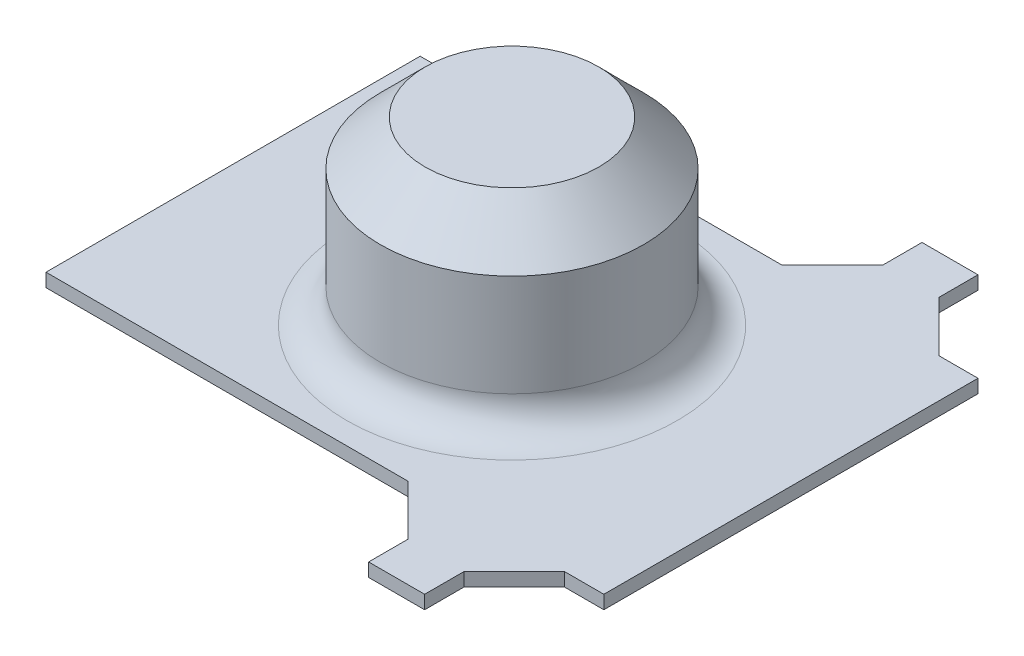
ISO-10303-21;
HEADER;
FILE_DESCRIPTION(('STEP AP214'),'2;1');
FILE_NAME('part.step','',(''),(''),'','','');
FILE_SCHEMA(('AUTOMOTIVE_DESIGN { 1 0 10303 214 1 1 1 1 }'));
ENDSEC;
DATA;
#1=APPLICATION_CONTEXT('core data for automotive mechanical design processes');
#2=APPLICATION_PROTOCOL_DEFINITION('international standard','automotive_design',2000,#1);
#3=PRODUCT_CONTEXT('',#1,'mechanical');
#4=PRODUCT('Part','Part','',(#3));
#5=PRODUCT_RELATED_PRODUCT_CATEGORY('part','',(#4));
#6=PRODUCT_DEFINITION_FORMATION('','',#4);
#7=PRODUCT_DEFINITION_CONTEXT('part definition',#1,'design');
#8=PRODUCT_DEFINITION('design','',#6,#7);
#9=PRODUCT_DEFINITION_SHAPE('','',#8);
#10=(LENGTH_UNIT() NAMED_UNIT(*) SI_UNIT(.MILLI.,.METRE.));
#11=(NAMED_UNIT(*) PLANE_ANGLE_UNIT() SI_UNIT($,.RADIAN.));
#12=(NAMED_UNIT(*) SI_UNIT($,.STERADIAN.) SOLID_ANGLE_UNIT());
#13=UNCERTAINTY_MEASURE_WITH_UNIT(LENGTH_MEASURE(1.E-05),#10,'distance_accuracy_value','');
#14=(GEOMETRIC_REPRESENTATION_CONTEXT(3) GLOBAL_UNCERTAINTY_ASSIGNED_CONTEXT((#13)) GLOBAL_UNIT_ASSIGNED_CONTEXT((#10,
#11,#12)) REPRESENTATION_CONTEXT('',''));
#15=CARTESIAN_POINT('',(0.,0.,0.));
#16=DIRECTION('',(0.,0.,1.));
#17=DIRECTION('',(1.,0.,0.));
#18=AXIS2_PLACEMENT_3D('',#15,#16,#17);
#19=CARTESIAN_POINT('',(11.9,1.2,0.));
#20=DIRECTION('',(1.,0.,0.));
#21=DIRECTION('',(0.,0.,-1.));
#22=AXIS2_PLACEMENT_3D('',#19,#20,#21);
#23=PLANE('',#22);
#24=DIRECTION('',(0.,0.,1.));
#25=VECTOR('',#24,1.);
#26=CARTESIAN_POINT('',(11.9,0.,0.));
#27=LINE('',#26,#25);
#28=CARTESIAN_POINT('',(11.9,0.,-24.7));
#29=VERTEX_POINT('',#28);
#30=CARTESIAN_POINT('',(11.9,0.,-21.1971991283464));
#31=VERTEX_POINT('',#30);
#32=EDGE_CURVE('E193',#29,#31,#27,.T.);
#33=ORIENTED_EDGE('',*,*,#32,.T.);
#34=DIRECTION('',(0.,-1.,0.));
#35=VECTOR('',#34,1.);
#36=CARTESIAN_POINT('',(11.9,1.2,-21.1971991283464));
#37=LINE('',#36,#35);
#38=CARTESIAN_POINT('',(11.9,1.2,-21.1971991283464));
#39=VERTEX_POINT('',#38);
#40=EDGE_CURVE('E286',#39,#31,#37,.T.);
#41=ORIENTED_EDGE('',*,*,#40,.F.);
#42=DIRECTION('',(0.,0.,1.));
#43=VECTOR('',#42,1.);
#44=CARTESIAN_POINT('',(11.9,1.2,0.));
#45=LINE('',#44,#43);
#46=CARTESIAN_POINT('',(11.9,1.2,-24.7));
#47=VERTEX_POINT('',#46);
#48=EDGE_CURVE('E245',#47,#39,#45,.T.);
#49=ORIENTED_EDGE('',*,*,#48,.F.);
#50=DIRECTION('',(0.,-1.,0.));
#51=VECTOR('',#50,1.);
#52=CARTESIAN_POINT('',(11.9,1.2,-24.7));
#53=LINE('',#52,#51);
#54=EDGE_CURVE('E189',#47,#29,#53,.T.);
#55=ORIENTED_EDGE('',*,*,#54,.T.);
#56=EDGE_LOOP('',(#33,#41,#49,#55));
#57=FACE_BOUND('',#56,.T.);
#58=ADVANCED_FACE('F43',(#57),#23,.F.);
#59=CARTESIAN_POINT('',(-4.64859956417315,1.2,-4.6485995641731));
#60=DIRECTION('',(0.707106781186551,0.,0.707106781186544));
#61=DIRECTION('',(0.707106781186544,0.,-0.707106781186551));
#62=AXIS2_PLACEMENT_3D('',#59,#60,#61);
#63=PLANE('',#62);
#64=DIRECTION('',(-0.707106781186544,0.,0.707106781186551));
#65=VECTOR('',#64,1.);
#66=CARTESIAN_POINT('',(-4.64859956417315,0.,-4.6485995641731));
#67=LINE('',#66,#65);
#68=CARTESIAN_POINT('',(7.40280087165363,0.,-16.7));
#69=VERTEX_POINT('',#68);
#70=EDGE_CURVE('E197',#31,#69,#67,.T.);
#71=ORIENTED_EDGE('',*,*,#70,.T.);
#72=DIRECTION('',(0.,-1.,0.));
#73=VECTOR('',#72,1.);
#74=CARTESIAN_POINT('',(7.40280087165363,1.2,-16.7));
#75=LINE('',#74,#73);
#76=CARTESIAN_POINT('',(7.40280087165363,1.2,-16.7));
#77=VERTEX_POINT('',#76);
#78=EDGE_CURVE('E283',#77,#69,#75,.T.);
#79=ORIENTED_EDGE('',*,*,#78,.F.);
#80=DIRECTION('',(-0.707106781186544,0.,0.707106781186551));
#81=VECTOR('',#80,1.);
#82=CARTESIAN_POINT('',(-4.64859956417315,1.2,-4.6485995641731));
#83=LINE('',#82,#81);
#84=EDGE_CURVE('E129',#39,#77,#83,.T.);
#85=ORIENTED_EDGE('',*,*,#84,.F.);
#86=ORIENTED_EDGE('',*,*,#40,.T.);
#87=EDGE_LOOP('',(#71,#79,#85,#86));
#88=FACE_BOUND('',#87,.T.);
#89=ADVANCED_FACE('F313',(#88),#63,.F.);
#90=CARTESIAN_POINT('',(0.,1.2,-16.7));
#91=DIRECTION('',(0.,0.,-1.));
#92=DIRECTION('',(-1.,0.,0.));
#93=AXIS2_PLACEMENT_3D('',#90,#91,#92);
#94=PLANE('',#93);
#95=DIRECTION('',(1.,0.,0.));
#96=VECTOR('',#95,1.);
#97=CARTESIAN_POINT('',(0.,0.,-16.7));
#98=LINE('',#97,#96);
#99=CARTESIAN_POINT('',(-24.9,0.,-16.7));
#100=VERTEX_POINT('',#99);
#101=EDGE_CURVE('E201',#100,#69,#98,.T.);
#102=ORIENTED_EDGE('',*,*,#101,.F.);
#103=DIRECTION('',(0.,-1.,0.));
#104=VECTOR('',#103,1.);
#105=CARTESIAN_POINT('',(-24.9,1.2,-16.7));
#106=LINE('',#105,#104);
#107=CARTESIAN_POINT('',(-24.9,1.2,-16.7));
#108=VERTEX_POINT('',#107);
#109=EDGE_CURVE('E280',#108,#100,#106,.T.);
#110=ORIENTED_EDGE('',*,*,#109,.F.);
#111=DIRECTION('',(1.,0.,0.));
#112=VECTOR('',#111,1.);
#113=CARTESIAN_POINT('',(0.,1.2,-16.7));
#114=LINE('',#113,#112);
#115=EDGE_CURVE('E533',#108,#77,#114,.T.);
#116=ORIENTED_EDGE('',*,*,#115,.T.);
#117=ORIENTED_EDGE('',*,*,#78,.T.);
#118=EDGE_LOOP('',(#102,#110,#116,#117));
#119=FACE_BOUND('',#118,.T.);
#120=ADVANCED_FACE('F319',(#119),#94,.T.);
#121=CARTESIAN_POINT('',(-24.9,1.2,0.));
#122=DIRECTION('',(-1.,0.,0.));
#123=DIRECTION('',(0.,0.,1.));
#124=AXIS2_PLACEMENT_3D('',#121,#122,#123);
#125=PLANE('',#124);
#126=DIRECTION('',(0.,0.,-1.));
#127=VECTOR('',#126,1.);
#128=CARTESIAN_POINT('',(-24.9,0.,0.));
#129=LINE('',#128,#127);
#130=CARTESIAN_POINT('',(-24.9,0.,16.7));
#131=VERTEX_POINT('',#130);
#132=EDGE_CURVE('E205',#131,#100,#129,.T.);
#133=ORIENTED_EDGE('',*,*,#132,.F.);
#134=DIRECTION('',(0.,-1.,0.));
#135=VECTOR('',#134,1.);
#136=CARTESIAN_POINT('',(-24.9,1.2,16.7));
#137=LINE('',#136,#135);
#138=CARTESIAN_POINT('',(-24.9,1.2,16.7));
#139=VERTEX_POINT('',#138);
#140=EDGE_CURVE('E277',#139,#131,#137,.T.);
#141=ORIENTED_EDGE('',*,*,#140,.F.);
#142=DIRECTION('',(0.,0.,-1.));
#143=VECTOR('',#142,1.);
#144=CARTESIAN_POINT('',(-24.9,1.2,0.));
#145=LINE('',#144,#143);
#146=EDGE_CURVE('E530',#139,#108,#145,.T.);
#147=ORIENTED_EDGE('',*,*,#146,.T.);
#148=ORIENTED_EDGE('',*,*,#109,.T.);
#149=EDGE_LOOP('',(#133,#141,#147,#148));
#150=FACE_BOUND('',#149,.T.);
#151=ADVANCED_FACE('F325',(#150),#125,.T.);
#152=CARTESIAN_POINT('',(0.,1.2,16.7));
#153=DIRECTION('',(0.,0.,-1.));
#154=DIRECTION('',(-1.,0.,0.));
#155=AXIS2_PLACEMENT_3D('',#152,#153,#154);
#156=PLANE('',#155);
#157=DIRECTION('',(1.,0.,0.));
#158=VECTOR('',#157,1.);
#159=CARTESIAN_POINT('',(0.,0.,16.7));
#160=LINE('',#159,#158);
#161=CARTESIAN_POINT('',(7.40280087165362,0.,16.7));
#162=VERTEX_POINT('',#161);
#163=EDGE_CURVE('E210',#131,#162,#160,.T.);
#164=ORIENTED_EDGE('',*,*,#163,.T.);
#165=DIRECTION('',(0.,-1.,0.));
#166=VECTOR('',#165,1.);
#167=CARTESIAN_POINT('',(7.40280087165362,1.2,16.7));
#168=LINE('',#167,#166);
#169=CARTESIAN_POINT('',(7.40280087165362,1.2,16.7));
#170=VERTEX_POINT('',#169);
#171=EDGE_CURVE('E274',#170,#162,#168,.T.);
#172=ORIENTED_EDGE('',*,*,#171,.F.);
#173=DIRECTION('',(1.,0.,0.));
#174=VECTOR('',#173,1.);
#175=CARTESIAN_POINT('',(0.,1.2,16.7));
#176=LINE('',#175,#174);
#177=EDGE_CURVE('E532',#139,#170,#176,.T.);
#178=ORIENTED_EDGE('',*,*,#177,.F.);
#179=ORIENTED_EDGE('',*,*,#140,.T.);
#180=EDGE_LOOP('',(#164,#172,#178,#179));
#181=FACE_BOUND('',#180,.T.);
#182=ADVANCED_FACE('F328',(#181),#156,.F.);
#183=CARTESIAN_POINT('',(-4.64859956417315,1.2,4.6485995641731));
#184=DIRECTION('',(-0.707106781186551,0.,0.707106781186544));
#185=DIRECTION('',(0.707106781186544,0.,0.707106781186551));
#186=AXIS2_PLACEMENT_3D('',#183,#184,#185);
#187=PLANE('',#186);
#188=DIRECTION('',(-0.707106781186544,0.,-0.707106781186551));
#189=VECTOR('',#188,1.);
#190=CARTESIAN_POINT('',(-4.64859956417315,0.,4.6485995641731));
#191=LINE('',#190,#189);
#192=CARTESIAN_POINT('',(11.9,0.,21.1971991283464));
#193=VERTEX_POINT('',#192);
#194=EDGE_CURVE('E214',#193,#162,#191,.T.);
#195=ORIENTED_EDGE('',*,*,#194,.F.);
#196=DIRECTION('',(0.,-1.,0.));
#197=VECTOR('',#196,1.);
#198=CARTESIAN_POINT('',(11.9,1.2,21.1971991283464));
#199=LINE('',#198,#197);
#200=CARTESIAN_POINT('',(11.9,1.2,21.1971991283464));
#201=VERTEX_POINT('',#200);
#202=EDGE_CURVE('E271',#201,#193,#199,.T.);
#203=ORIENTED_EDGE('',*,*,#202,.F.);
#204=DIRECTION('',(-0.707106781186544,0.,-0.707106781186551));
#205=VECTOR('',#204,1.);
#206=CARTESIAN_POINT('',(-4.64859956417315,1.2,4.6485995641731));
#207=LINE('',#206,#205);
#208=EDGE_CURVE('E537',#201,#170,#207,.T.);
#209=ORIENTED_EDGE('',*,*,#208,.T.);
#210=ORIENTED_EDGE('',*,*,#171,.T.);
#211=EDGE_LOOP('',(#195,#203,#209,#210));
#212=FACE_BOUND('',#211,.T.);
#213=ADVANCED_FACE('F330',(#212),#187,.T.);
#214=CARTESIAN_POINT('',(11.9,1.2,0.));
#215=DIRECTION('',(-1.,0.,0.));
#216=DIRECTION('',(0.,0.,1.));
#217=AXIS2_PLACEMENT_3D('',#214,#215,#216);
#218=PLANE('',#217);
#219=DIRECTION('',(0.,0.,-1.));
#220=VECTOR('',#219,1.);
#221=CARTESIAN_POINT('',(11.9,0.,0.));
#222=LINE('',#221,#220);
#223=CARTESIAN_POINT('',(11.9,0.,24.7));
#224=VERTEX_POINT('',#223);
#225=EDGE_CURVE('E219',#224,#193,#222,.T.);
#226=ORIENTED_EDGE('',*,*,#225,.F.);
#227=DIRECTION('',(0.,-1.,0.));
#228=VECTOR('',#227,1.);
#229=CARTESIAN_POINT('',(11.9,1.2,24.7));
#230=LINE('',#229,#228);
#231=CARTESIAN_POINT('',(11.9,1.2,24.7));
#232=VERTEX_POINT('',#231);
#233=EDGE_CURVE('E268',#232,#224,#230,.T.);
#234=ORIENTED_EDGE('',*,*,#233,.F.);
#235=DIRECTION('',(0.,0.,-1.));
#236=VECTOR('',#235,1.);
#237=CARTESIAN_POINT('',(11.9,1.2,0.));
#238=LINE('',#237,#236);
#239=EDGE_CURVE('E546',#232,#201,#238,.T.);
#240=ORIENTED_EDGE('',*,*,#239,.T.);
#241=ORIENTED_EDGE('',*,*,#202,.T.);
#242=EDGE_LOOP('',(#226,#234,#240,#241));
#243=FACE_BOUND('',#242,.T.);
#244=ADVANCED_FACE('F333',(#243),#218,.T.);
#245=CARTESIAN_POINT('',(0.,1.2,24.7));
#246=DIRECTION('',(0.,0.,1.));
#247=DIRECTION('',(1.,0.,0.));
#248=AXIS2_PLACEMENT_3D('',#245,#246,#247);
#249=PLANE('',#248);
#250=DIRECTION('',(-1.,0.,0.));
#251=VECTOR('',#250,1.);
#252=CARTESIAN_POINT('',(0.,0.,24.7));
#253=LINE('',#252,#251);
#254=CARTESIAN_POINT('',(16.9,0.,24.7));
#255=VERTEX_POINT('',#254);
#256=EDGE_CURVE('E223',#255,#224,#253,.T.);
#257=ORIENTED_EDGE('',*,*,#256,.F.);
#258=DIRECTION('',(0.,-1.,0.));
#259=VECTOR('',#258,1.);
#260=CARTESIAN_POINT('',(16.9,1.2,24.7));
#261=LINE('',#260,#259);
#262=CARTESIAN_POINT('',(16.9,1.2,24.7));
#263=VERTEX_POINT('',#262);
#264=EDGE_CURVE('E265',#263,#255,#261,.T.);
#265=ORIENTED_EDGE('',*,*,#264,.F.);
#266=DIRECTION('',(-1.,0.,0.));
#267=VECTOR('',#266,1.);
#268=CARTESIAN_POINT('',(0.,1.2,24.7));
#269=LINE('',#268,#267);
#270=EDGE_CURVE('E550',#263,#232,#269,.T.);
#271=ORIENTED_EDGE('',*,*,#270,.T.);
#272=ORIENTED_EDGE('',*,*,#233,.T.);
#273=EDGE_LOOP('',(#257,#265,#271,#272));
#274=FACE_BOUND('',#273,.T.);
#275=ADVANCED_FACE('F337',(#274),#249,.T.);
#276=CARTESIAN_POINT('',(16.9,1.2,0.));
#277=DIRECTION('',(1.,0.,0.));
#278=DIRECTION('',(0.,0.,-1.));
#279=AXIS2_PLACEMENT_3D('',#276,#277,#278);
#280=PLANE('',#279);
#281=DIRECTION('',(0.,0.,1.));
#282=VECTOR('',#281,1.);
#283=CARTESIAN_POINT('',(16.9,0.,0.));
#284=LINE('',#283,#282);
#285=CARTESIAN_POINT('',(16.9,0.,21.1971991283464));
#286=VERTEX_POINT('',#285);
#287=EDGE_CURVE('E227',#286,#255,#284,.T.);
#288=ORIENTED_EDGE('',*,*,#287,.F.);
#289=DIRECTION('',(0.,-1.,0.));
#290=VECTOR('',#289,1.);
#291=CARTESIAN_POINT('',(16.9,1.2,21.1971991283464));
#292=LINE('',#291,#290);
#293=CARTESIAN_POINT('',(16.9,1.2,21.1971991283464));
#294=VERTEX_POINT('',#293);
#295=EDGE_CURVE('E262',#294,#286,#292,.T.);
#296=ORIENTED_EDGE('',*,*,#295,.F.);
#297=DIRECTION('',(0.,0.,1.));
#298=VECTOR('',#297,1.);
#299=CARTESIAN_POINT('',(16.9,1.2,0.));
#300=LINE('',#299,#298);
#301=EDGE_CURVE('E554',#294,#263,#300,.T.);
#302=ORIENTED_EDGE('',*,*,#301,.T.);
#303=ORIENTED_EDGE('',*,*,#264,.T.);
#304=EDGE_LOOP('',(#288,#296,#302,#303));
#305=FACE_BOUND('',#304,.T.);
#306=ADVANCED_FACE('F341',(#305),#280,.T.);
#307=CARTESIAN_POINT('',(19.0485995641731,1.2,19.0485995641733));
#308=DIRECTION('',(0.707106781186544,0.,0.707106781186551));
#309=DIRECTION('',(0.707106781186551,0.,-0.707106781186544));
#310=AXIS2_PLACEMENT_3D('',#307,#308,#309);
#311=PLANE('',#310);
#312=DIRECTION('',(-0.707106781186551,0.,0.707106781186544));
#313=VECTOR('',#312,1.);
#314=CARTESIAN_POINT('',(19.0485995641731,0.,19.0485995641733));
#315=LINE('',#314,#313);
#316=CARTESIAN_POINT('',(21.3971991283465,0.,16.7));
#317=VERTEX_POINT('',#316);
#318=EDGE_CURVE('E231',#317,#286,#315,.T.);
#319=ORIENTED_EDGE('',*,*,#318,.F.);
#320=DIRECTION('',(0.,-1.,0.));
#321=VECTOR('',#320,1.);
#322=CARTESIAN_POINT('',(21.3971991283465,1.2,16.7));
#323=LINE('',#322,#321);
#324=CARTESIAN_POINT('',(21.3971991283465,1.2,16.7));
#325=VERTEX_POINT('',#324);
#326=EDGE_CURVE('E259',#325,#317,#323,.T.);
#327=ORIENTED_EDGE('',*,*,#326,.F.);
#328=DIRECTION('',(-0.707106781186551,0.,0.707106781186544));
#329=VECTOR('',#328,1.);
#330=CARTESIAN_POINT('',(19.0485995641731,1.2,19.0485995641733));
#331=LINE('',#330,#329);
#332=EDGE_CURVE('E558',#325,#294,#331,.T.);
#333=ORIENTED_EDGE('',*,*,#332,.T.);
#334=ORIENTED_EDGE('',*,*,#295,.T.);
#335=EDGE_LOOP('',(#319,#327,#333,#334));
#336=FACE_BOUND('',#335,.T.);
#337=ADVANCED_FACE('F345',(#336),#311,.T.);
#338=CARTESIAN_POINT('',(24.9,0.,16.7));
#339=VERTEX_POINT('',#338);
#340=EDGE_CURVE('E215',#317,#339,#160,.T.);
#341=ORIENTED_EDGE('',*,*,#340,.T.);
#342=DIRECTION('',(0.,-1.,0.));
#343=VECTOR('',#342,1.);
#344=CARTESIAN_POINT('',(24.9,1.2,16.7));
#345=LINE('',#344,#343);
#346=CARTESIAN_POINT('',(24.9,1.2,16.7));
#347=VERTEX_POINT('',#346);
#348=EDGE_CURVE('E255',#347,#339,#345,.T.);
#349=ORIENTED_EDGE('',*,*,#348,.F.);
#350=EDGE_CURVE('E539',#325,#347,#176,.T.);
#351=ORIENTED_EDGE('',*,*,#350,.F.);
#352=ORIENTED_EDGE('',*,*,#326,.T.);
#353=EDGE_LOOP('',(#341,#349,#351,#352));
#354=FACE_BOUND('',#353,.T.);
#355=ADVANCED_FACE('F349',(#354),#156,.F.);
#356=CARTESIAN_POINT('',(24.9,1.2,0.));
#357=DIRECTION('',(-1.,0.,0.));
#358=DIRECTION('',(0.,0.,1.));
#359=AXIS2_PLACEMENT_3D('',#356,#357,#358);
#360=PLANE('',#359);
#361=DIRECTION('',(0.,0.,-1.));
#362=VECTOR('',#361,1.);
#363=CARTESIAN_POINT('',(24.9,0.,0.));
#364=LINE('',#363,#362);
#365=CARTESIAN_POINT('',(24.9,0.,-16.7));
#366=VERTEX_POINT('',#365);
#367=EDGE_CURVE('E235',#339,#366,#364,.T.);
#368=ORIENTED_EDGE('',*,*,#367,.T.);
#369=DIRECTION('',(0.,-1.,0.));
#370=VECTOR('',#369,1.);
#371=CARTESIAN_POINT('',(24.9,1.2,-16.7));
#372=LINE('',#371,#370);
#373=CARTESIAN_POINT('',(24.9,1.2,-16.7));
#374=VERTEX_POINT('',#373);
#375=EDGE_CURVE('E252',#374,#366,#372,.T.);
#376=ORIENTED_EDGE('',*,*,#375,.F.);
#377=DIRECTION('',(0.,0.,-1.));
#378=VECTOR('',#377,1.);
#379=CARTESIAN_POINT('',(24.9,1.2,0.));
#380=LINE('',#379,#378);
#381=EDGE_CURVE('E561',#347,#374,#380,.T.);
#382=ORIENTED_EDGE('',*,*,#381,.F.);
#383=ORIENTED_EDGE('',*,*,#348,.T.);
#384=EDGE_LOOP('',(#368,#376,#382,#383));
#385=FACE_BOUND('',#384,.T.);
#386=ADVANCED_FACE('F353',(#385),#360,.F.);
#387=CARTESIAN_POINT('',(21.3971991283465,0.,-16.7));
#388=VERTEX_POINT('',#387);
#389=EDGE_CURVE('E206',#388,#366,#98,.T.);
#390=ORIENTED_EDGE('',*,*,#389,.F.);
#391=DIRECTION('',(0.,-1.,0.));
#392=VECTOR('',#391,1.);
#393=CARTESIAN_POINT('',(21.3971991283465,1.2,-16.7));
#394=LINE('',#393,#392);
#395=CARTESIAN_POINT('',(21.3971991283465,1.2,-16.7));
#396=VERTEX_POINT('',#395);
#397=EDGE_CURVE('E182',#396,#388,#394,.T.);
#398=ORIENTED_EDGE('',*,*,#397,.F.);
#399=EDGE_CURVE('E173',#396,#374,#114,.T.);
#400=ORIENTED_EDGE('',*,*,#399,.T.);
#401=ORIENTED_EDGE('',*,*,#375,.T.);
#402=EDGE_LOOP('',(#390,#398,#400,#401));
#403=FACE_BOUND('',#402,.T.);
#404=ADVANCED_FACE('F357',(#403),#94,.T.);
#405=CARTESIAN_POINT('',(19.0485995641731,1.2,-19.0485995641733));
#406=DIRECTION('',(-0.707106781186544,0.,0.707106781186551));
#407=DIRECTION('',(0.707106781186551,0.,0.707106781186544));
#408=AXIS2_PLACEMENT_3D('',#405,#406,#407);
#409=PLANE('',#408);
#410=DIRECTION('',(-0.707106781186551,0.,-0.707106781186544));
#411=VECTOR('',#410,1.);
#412=CARTESIAN_POINT('',(19.0485995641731,0.,-19.0485995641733));
#413=LINE('',#412,#411);
#414=CARTESIAN_POINT('',(16.9,0.,-21.1971991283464));
#415=VERTEX_POINT('',#414);
#416=EDGE_CURVE('E180',#388,#415,#413,.T.);
#417=ORIENTED_EDGE('',*,*,#416,.T.);
#418=DIRECTION('',(0.,-1.,0.));
#419=VECTOR('',#418,1.);
#420=CARTESIAN_POINT('',(16.9,1.2,-21.1971991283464));
#421=LINE('',#420,#419);
#422=CARTESIAN_POINT('',(16.9,1.2,-21.1971991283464));
#423=VERTEX_POINT('',#422);
#424=EDGE_CURVE('E177',#423,#415,#421,.T.);
#425=ORIENTED_EDGE('',*,*,#424,.F.);
#426=DIRECTION('',(-0.707106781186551,0.,-0.707106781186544));
#427=VECTOR('',#426,1.);
#428=CARTESIAN_POINT('',(19.0485995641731,1.2,-19.0485995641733));
#429=LINE('',#428,#427);
#430=EDGE_CURVE('E167',#396,#423,#429,.T.);
#431=ORIENTED_EDGE('',*,*,#430,.F.);
#432=ORIENTED_EDGE('',*,*,#397,.T.);
#433=EDGE_LOOP('',(#417,#425,#431,#432));
#434=FACE_BOUND('',#433,.T.);
#435=ADVANCED_FACE('F178',(#434),#409,.F.);
#436=CARTESIAN_POINT('',(16.9,1.2,0.));
#437=DIRECTION('',(-1.,0.,0.));
#438=DIRECTION('',(0.,0.,1.));
#439=AXIS2_PLACEMENT_3D('',#436,#437,#438);
#440=PLANE('',#439);
#441=DIRECTION('',(0.,0.,-1.));
#442=VECTOR('',#441,1.);
#443=CARTESIAN_POINT('',(16.9,0.,0.));
#444=LINE('',#443,#442);
#445=CARTESIAN_POINT('',(16.9,0.,-24.7));
#446=VERTEX_POINT('',#445);
#447=EDGE_CURVE('E114',#415,#446,#444,.T.);
#448=ORIENTED_EDGE('',*,*,#447,.T.);
#449=DIRECTION('',(0.,-1.,0.));
#450=VECTOR('',#449,1.);
#451=CARTESIAN_POINT('',(16.9,1.2,-24.7));
#452=LINE('',#451,#450);
#453=CARTESIAN_POINT('',(16.9,1.2,-24.7));
#454=VERTEX_POINT('',#453);
#455=EDGE_CURVE('E183',#454,#446,#452,.T.);
#456=ORIENTED_EDGE('',*,*,#455,.F.);
#457=DIRECTION('',(0.,0.,-1.));
#458=VECTOR('',#457,1.);
#459=CARTESIAN_POINT('',(16.9,1.2,0.));
#460=LINE('',#459,#458);
#461=EDGE_CURVE('E171',#423,#454,#460,.T.);
#462=ORIENTED_EDGE('',*,*,#461,.F.);
#463=ORIENTED_EDGE('',*,*,#424,.T.);
#464=EDGE_LOOP('',(#448,#456,#462,#463));
#465=FACE_BOUND('',#464,.T.);
#466=ADVANCED_FACE('F185',(#465),#440,.F.);
#467=CARTESIAN_POINT('',(0.,1.2,-24.7));
#468=DIRECTION('',(0.,0.,1.));
#469=DIRECTION('',(1.,0.,0.));
#470=AXIS2_PLACEMENT_3D('',#467,#468,#469);
#471=PLANE('',#470);
#472=DIRECTION('',(-1.,0.,0.));
#473=VECTOR('',#472,1.);
#474=CARTESIAN_POINT('',(0.,0.,-24.7));
#475=LINE('',#474,#473);
#476=EDGE_CURVE('E120',#446,#29,#475,.T.);
#477=ORIENTED_EDGE('',*,*,#476,.T.);
#478=ORIENTED_EDGE('',*,*,#54,.F.);
#479=DIRECTION('',(-1.,0.,0.));
#480=VECTOR('',#479,1.);
#481=CARTESIAN_POINT('',(0.,1.2,-24.7));
#482=LINE('',#481,#480);
#483=EDGE_CURVE('E61',#454,#47,#482,.T.);
#484=ORIENTED_EDGE('',*,*,#483,.F.);
#485=ORIENTED_EDGE('',*,*,#455,.T.);
#486=EDGE_LOOP('',(#477,#478,#484,#485));
#487=FACE_BOUND('',#486,.T.);
#488=ADVANCED_FACE('F366',(#487),#471,.F.);
#489=CARTESIAN_POINT('',(0.,1.2,0.));
#490=DIRECTION('',(0.,1.,0.));
#491=DIRECTION('',(0.,0.,1.));
#492=AXIS2_PLACEMENT_3D('',#489,#490,#491);
#493=PLANE('',#492);
#494=CARTESIAN_POINT('',(0.,1.2,0.));
#495=DIRECTION('',(0.,1.,0.));
#496=DIRECTION('',(0.,0.,1.));
#497=AXIS2_PLACEMENT_3D('',#494,#495,#496);
#498=CIRCLE('',#497,14.75);
#499=CARTESIAN_POINT('',(0.,1.2,14.75));
#500=VERTEX_POINT('',#499);
#501=EDGE_CURVE('E11',#500,#500,#498,.F.);
#502=ORIENTED_EDGE('',*,*,#501,.T.);
#503=EDGE_LOOP('',(#502));
#504=FACE_BOUND('',#503,.T.);
#505=ORIENTED_EDGE('',*,*,#48,.T.);
#506=ORIENTED_EDGE('',*,*,#84,.T.);
#507=ORIENTED_EDGE('',*,*,#115,.F.);
#508=ORIENTED_EDGE('',*,*,#146,.F.);
#509=ORIENTED_EDGE('',*,*,#177,.T.);
#510=ORIENTED_EDGE('',*,*,#208,.F.);
#511=ORIENTED_EDGE('',*,*,#239,.F.);
#512=ORIENTED_EDGE('',*,*,#270,.F.);
#513=ORIENTED_EDGE('',*,*,#301,.F.);
#514=ORIENTED_EDGE('',*,*,#332,.F.);
#515=ORIENTED_EDGE('',*,*,#350,.T.);
#516=ORIENTED_EDGE('',*,*,#381,.T.);
#517=ORIENTED_EDGE('',*,*,#399,.F.);
#518=ORIENTED_EDGE('',*,*,#430,.T.);
#519=ORIENTED_EDGE('',*,*,#461,.T.);
#520=ORIENTED_EDGE('',*,*,#483,.T.);
#521=EDGE_LOOP('',(#505,#506,#507,#508,#509,#510,#511,#512,#513,#514,#515,#516,#517,#518,#519,#520));
#522=FACE_BOUND('',#521,.T.);
#523=ADVANCED_FACE('F169',(#504,#522),#493,.T.);
#524=CARTESIAN_POINT('',(0.,0.,0.));
#525=DIRECTION('',(0.,1.,0.));
#526=DIRECTION('',(0.,0.,1.));
#527=AXIS2_PLACEMENT_3D('',#524,#525,#526);
#528=PLANE('',#527);
#529=ORIENTED_EDGE('',*,*,#32,.F.);
#530=ORIENTED_EDGE('',*,*,#476,.F.);
#531=ORIENTED_EDGE('',*,*,#447,.F.);
#532=ORIENTED_EDGE('',*,*,#416,.F.);
#533=ORIENTED_EDGE('',*,*,#389,.T.);
#534=ORIENTED_EDGE('',*,*,#367,.F.);
#535=ORIENTED_EDGE('',*,*,#340,.F.);
#536=ORIENTED_EDGE('',*,*,#318,.T.);
#537=ORIENTED_EDGE('',*,*,#287,.T.);
#538=ORIENTED_EDGE('',*,*,#256,.T.);
#539=ORIENTED_EDGE('',*,*,#225,.T.);
#540=ORIENTED_EDGE('',*,*,#194,.T.);
#541=ORIENTED_EDGE('',*,*,#163,.F.);
#542=ORIENTED_EDGE('',*,*,#132,.T.);
#543=ORIENTED_EDGE('',*,*,#101,.T.);
#544=ORIENTED_EDGE('',*,*,#70,.F.);
#545=EDGE_LOOP('',(#529,#530,#531,#532,#533,#534,#535,#536,#537,#538,#539,#540,#541,#542,#543,#544));
#546=FACE_BOUND('',#545,.T.);
#547=ADVANCED_FACE('F369',(#546),#528,.F.);
#548=CARTESIAN_POINT('',(0.,17.3,0.));
#549=DIRECTION('',(0.,-1.,0.));
#550=DIRECTION('',(0.,0.,-1.));
#551=AXIS2_PLACEMENT_3D('',#548,#549,#550);
#552=CYLINDRICAL_SURFACE('',#551,11.75);
#553=CARTESIAN_POINT('',(0.,4.2,0.));
#554=DIRECTION('',(0.,1.,0.));
#555=DIRECTION('',(0.,0.,1.));
#556=AXIS2_PLACEMENT_3D('',#553,#554,#555);
#557=CIRCLE('',#556,11.75);
#558=CARTESIAN_POINT('',(0.,4.2,11.75));
#559=VERTEX_POINT('',#558);
#560=EDGE_CURVE('E53',#559,#559,#557,.T.);
#561=ORIENTED_EDGE('',*,*,#560,.T.);
#562=EDGE_LOOP('',(#561));
#563=FACE_BOUND('',#562,.T.);
#564=CARTESIAN_POINT('',(0.,13.3,0.));
#565=DIRECTION('',(0.,1.,0.));
#566=DIRECTION('',(0.,0.,1.));
#567=AXIS2_PLACEMENT_3D('',#564,#565,#566);
#568=CIRCLE('',#567,11.75);
#569=CARTESIAN_POINT('',(0.,13.3,11.75));
#570=VERTEX_POINT('',#569);
#571=EDGE_CURVE('E293',#570,#570,#568,.F.);
#572=ORIENTED_EDGE('',*,*,#571,.T.);
#573=EDGE_LOOP('',(#572));
#574=FACE_BOUND('',#573,.T.);
#575=ADVANCED_FACE('F300',(#563,#574),#552,.T.);
#576=CARTESIAN_POINT('',(0.,17.3,0.));
#577=DIRECTION('',(0.,1.,0.));
#578=DIRECTION('',(0.,0.,1.));
#579=AXIS2_PLACEMENT_3D('',#576,#577,#578);
#580=PLANE('',#579);
#581=CARTESIAN_POINT('',(0.,17.3,0.));
#582=DIRECTION('',(0.,1.,0.));
#583=DIRECTION('',(0.,0.,1.));
#584=AXIS2_PLACEMENT_3D('',#581,#582,#583);
#585=CIRCLE('',#584,7.75);
#586=CARTESIAN_POINT('',(0.,17.3,7.74999999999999));
#587=VERTEX_POINT('',#586);
#588=EDGE_CURVE('E289',#587,#587,#585,.T.);
#589=ORIENTED_EDGE('',*,*,#588,.T.);
#590=EDGE_LOOP('',(#589));
#591=FACE_BOUND('',#590,.T.);
#592=ADVANCED_FACE('F309',(#591),#580,.T.);
#593=CARTESIAN_POINT('',(0.,17.3,0.));
#594=DIRECTION('',(0.,-1.,0.));
#595=DIRECTION('',(0.,0.,-1.));
#596=AXIS2_PLACEMENT_3D('',#593,#594,#595);
#597=CONICAL_SURFACE('',#596,7.75,0.785398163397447);
#598=ORIENTED_EDGE('',*,*,#571,.F.);
#599=EDGE_LOOP('',(#598));
#600=FACE_BOUND('',#599,.T.);
#601=ORIENTED_EDGE('',*,*,#588,.F.);
#602=EDGE_LOOP('',(#601));
#603=FACE_BOUND('',#602,.T.);
#604=ADVANCED_FACE('F304',(#600,#603),#597,.T.);
#605=CARTESIAN_POINT('',(0.,4.2,0.));
#606=DIRECTION('',(0.,1.,0.));
#607=DIRECTION('',(0.,0.,1.));
#608=AXIS2_PLACEMENT_3D('',#605,#606,#607);
#609=TOROIDAL_SURFACE('',#608,14.75,3.);
#610=ORIENTED_EDGE('',*,*,#501,.F.);
#611=EDGE_LOOP('',(#610));
#612=FACE_BOUND('',#611,.T.);
#613=ORIENTED_EDGE('',*,*,#560,.F.);
#614=EDGE_LOOP('',(#613));
#615=FACE_BOUND('',#614,.T.);
#616=ADVANCED_FACE('F45',(#612,#615),#609,.F.);
#617=CLOSED_SHELL('',(#58,#89,#120,#151,#182,#213,#244,#275,#306,#337,#355,#386,#404,#435,#466,
#488,#523,#547,#575,#592,#604,#616));
#618=MANIFOLD_SOLID_BREP('B2',#617);
#619=ADVANCED_BREP_SHAPE_REPRESENTATION('',(#18,#618),#14);
#620=SHAPE_DEFINITION_REPRESENTATION(#9,#619);
ENDSEC;
END-ISO-10303-21;
